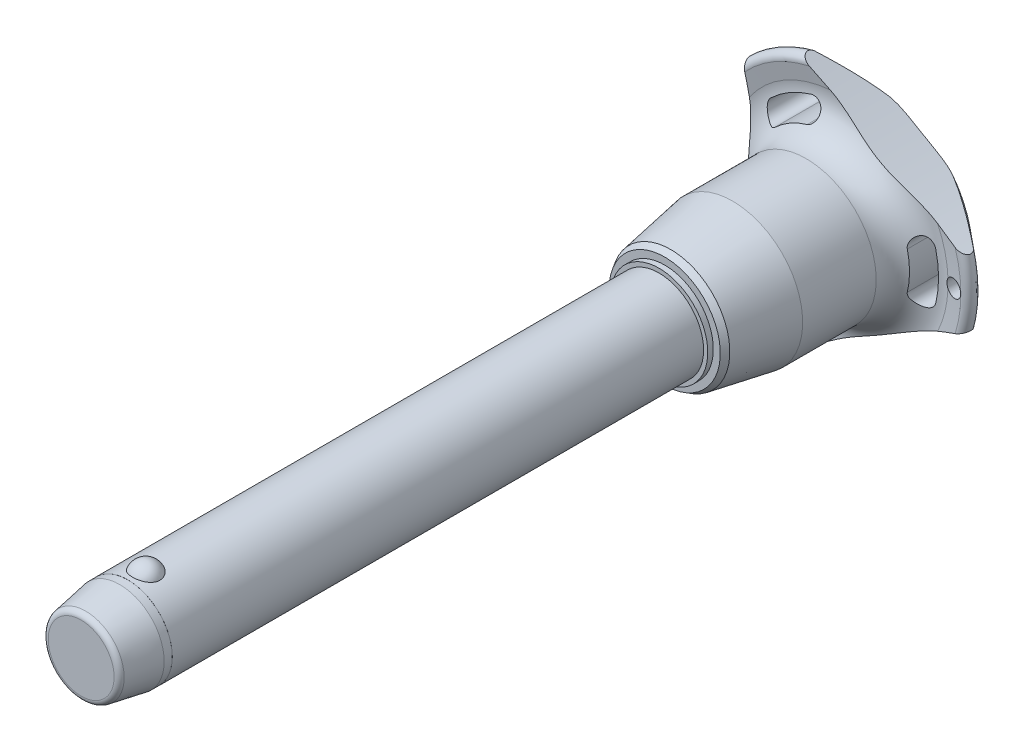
from build123d import *

# Parameters (mm, degrees)
SKETCH1_R           = 8
BOSS_EXTRUDE1_DEPTH = 90
SKETCH2_R           = 7
BOSS_EXTRUDE2_DEPTH = 39.7
BOSS_EXTRUDE3_START = 14
SKETCH1_2_R         = 8
BOSS_EXTRUDE3_DEPTH = 14
CHAMFER1_SIZE       = 7
CHAMFER1_SIZE2      = 1.234288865
FILLET1_R           = 1
SKETCH6_R           = 144.275
CUT_EXTRUDE1_DEPTH  = 134.999042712
CIRPATTERN1_COUNT   = 3
SKETCH7_R           = 1.5
CUT_EXTRUDE2_DEPTH  = 134.849189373
SKETCH8_R           = 8
SKETCH8_R_2         = 7.99
CUT_EXTRUDE3_DEPTH  = 8.4


with BuildPart() as part:
    # Sketch1 → Boss-Extrude1 (new body)
    with BuildSketch(Plane.XY):
        Circle(SKETCH1_R)
    extrude(amount=-BOSS_EXTRUDE1_DEPTH)

    # Sketch2 → Boss-Extrude2 (add)
    with BuildSketch(Plane(origin=(0, 0, -90), x_dir=(-1, 0, 0), z_dir=(0, 0, -1))):
        Circle(SKETCH2_R)
    extrude(amount=BOSS_EXTRUDE2_DEPTH)

    # Sketch3 → Revolve1 (revolve)
    with BuildSketch(Plane(origin=(0, 0, 0), x_dir=(0, 0, -1), z_dir=(1, 0, 0))):
        with BuildLine():
            Line((-2.387467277, 9.5), (-2.387467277, 4.2))
            ThreePointArc((-2.387467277, 4.2), (0.262532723, 6.85), (-2.387467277, 9.5))
        make_face()
        with BuildLine():
            Line((-2.387467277, -4.2), (-2.387467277, -9.5))
            ThreePointArc((-2.387467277, -9.5), (0.262532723, -6.85), (-2.387467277, -4.2))
        make_face()
    revolve(axis=Axis((0, -4.2, 2.387467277), (0, 1, 0)))

    # Sketch1_2 → Boss-Extrude3 (add)
    with BuildSketch(Plane.XY.offset(BOSS_EXTRUDE3_START)):
        Circle(SKETCH1_2_R)
    extrude(amount=-BOSS_EXTRUDE3_DEPTH)

    # Chamfer1
    chamfer1_edges = [part.edges().sort_by_distance(p)[0] for p in [
        (-8, 0, 14),
    ]]
    chamfer1_side = [part.faces().sort_by_distance(p)[0] for p in [
        (-8, 0, -38),
    ]]
    chamfer(chamfer1_edges, length=CHAMFER1_SIZE, length2=CHAMFER1_SIZE2, reference=chamfer1_side[0])

    # Fillet1
    fillet1_edges = [part.edges().sort_by_distance(p)[0] for p in [
        (-6.765711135, 0, 14),
        (7, 0, -129.7),
    ]]
    fillet(fillet1_edges, radius=FILLET1_R)

    # Sketch4 → Revolve2 (revolve)
    with BuildSketch(Plane(origin=(0, 0, 0), x_dir=(0, 0, -1), z_dir=(1, 0, 0)), mode=Mode.PRIVATE) as revolve2_sk:
        Polygon((90, 0), (90, 8.754868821), (91, 8.754868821), (91, 10.007796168), (92.085066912, 10.634259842), (103.233333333, 12.6), (116.466666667, 12.6), (116.466666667, 0), align=None)
    revolve(revolve2_sk.sketch.rotate(Axis((0, 0, -116.466666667), (0, 0, 1)), 90), axis=Axis((0, 0, -116.466666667), (0, 0, 1)))

    # Sketch5 → Revolve3 (revolve)
    with BuildSketch(Plane(origin=(0, 0, 0), x_dir=(0, 0, -1), z_dir=(1, 0, 0)), mode=Mode.PRIVATE) as revolve3_sk:
        with BuildLine():
            Line((122.379459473, 19.619255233), (121.900774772, 22.396148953))
            ThreePointArc((121.900774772, 22.396148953), (122.578274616, 23.688538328), (124.002586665, 23.371345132))
            Line((124.002586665, 23.371345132), (129.141488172, 17.247040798))
            ThreePointArc((129.141488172, 17.247040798), (129.7, 15.584758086), (128.978803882, 13.986322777))
            ThreePointArc((128.978803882, 13.986322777), (124.617427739, 7.589034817), (123.083333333, 0))
            Line((123.083333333, 0), (116.466666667, 0))
            Line((116.466666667, 0), (116.466666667, 12.6))
            ThreePointArc((116.466666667, 12.6), (121.055540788, 14.734481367), (122.379459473, 19.619255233))
        make_face()
    revolve(revolve3_sk.sketch.rotate(Axis((0, 0, -123.083333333), (0, 0, 1)), 90), axis=Axis((0, 0, -123.083333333), (0, 0, 1)))

    # Sketch6 → Cut-Extrude1 (cut, through all)
    with BuildSketch(Plane.XY):
        with Locations((-159.975, 0)):
            Circle(SKETCH6_R)
        with BuildLine():
            ThreePointArc((17.365443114, -4.192809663), (17.864441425, 0), (17.365443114, 4.192809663))
            ThreePointArc((17.365443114, 4.192809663), (15.247788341, 5.486749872), (13.953848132, 3.369095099))
            ThreePointArc((13.953848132, 3.369095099), (14.354813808, 0), (13.953848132, -3.369095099))
            ThreePointArc((13.953848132, -3.369095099), (15.247788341, -5.486749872), (17.365443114, -4.192809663))
        make_face()
    cut_extrude1 = extrude(amount=-CUT_EXTRUDE1_DEPTH, mode=Mode.SUBTRACT)

    # CirPattern1: Cut-Extrude1 ×3 about axis
    cirpattern1_axis = Axis((0, 0, 0), (0, 0, 1))
    for i in range(1, CIRPATTERN1_COUNT):
        add(cut_extrude1.rotate(cirpattern1_axis, i * 360 / CIRPATTERN1_COUNT), mode=Mode.SUBTRACT)

    # Sketch7 → Cut-Extrude2 (cut, through all)
    with BuildSketch(Plane.XY):
        with Locations(Location((20.864441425, 0, 0), (0, 0, 221.008319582))):
            Circle(SKETCH7_R)
    extrude(amount=-CUT_EXTRUDE2_DEPTH, mode=Mode.SUBTRACT)

    # Sketch8 → Cut-Extrude3 (cut)
    with BuildSketch(Plane.XY.offset(14)):
        Circle(SKETCH8_R)
        Circle(SKETCH8_R_2, mode=Mode.SUBTRACT)
    extrude(amount=-CUT_EXTRUDE3_DEPTH, mode=Mode.SUBTRACT)


solid = part.part
